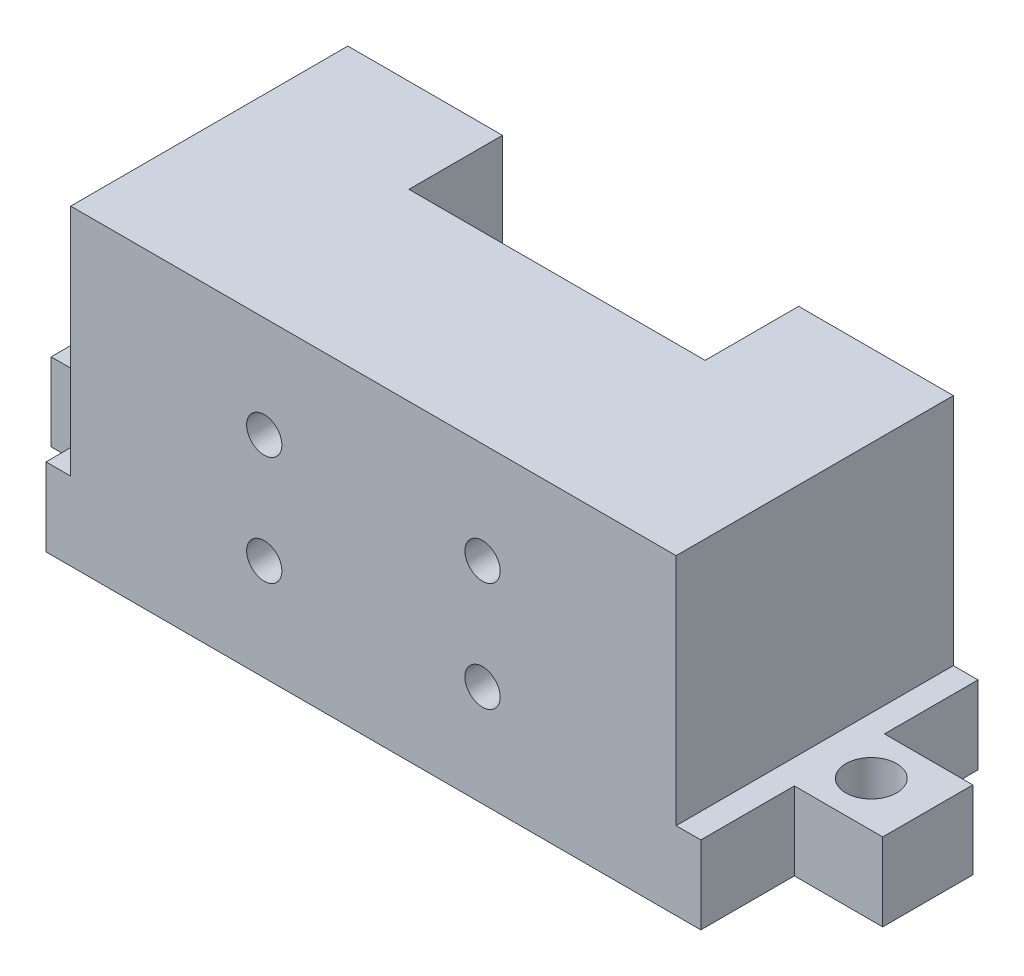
ISO-10303-21;
HEADER;
FILE_DESCRIPTION(('STEP AP214'),'2;1');
FILE_NAME('part.step','',(''),(''),'','','');
FILE_SCHEMA(('AUTOMOTIVE_DESIGN { 1 0 10303 214 1 1 1 1 }'));
ENDSEC;
DATA;
#1=APPLICATION_CONTEXT('core data for automotive mechanical design processes');
#2=APPLICATION_PROTOCOL_DEFINITION('international standard','automotive_design',2000,#1);
#3=PRODUCT_CONTEXT('',#1,'mechanical');
#4=PRODUCT('Part','Part','',(#3));
#5=PRODUCT_RELATED_PRODUCT_CATEGORY('part','',(#4));
#6=PRODUCT_DEFINITION_FORMATION('','',#4);
#7=PRODUCT_DEFINITION_CONTEXT('part definition',#1,'design');
#8=PRODUCT_DEFINITION('design','',#6,#7);
#9=PRODUCT_DEFINITION_SHAPE('','',#8);
#10=(LENGTH_UNIT() NAMED_UNIT(*) SI_UNIT(.MILLI.,.METRE.));
#11=(NAMED_UNIT(*) PLANE_ANGLE_UNIT() SI_UNIT($,.RADIAN.));
#12=(NAMED_UNIT(*) SI_UNIT($,.STERADIAN.) SOLID_ANGLE_UNIT());
#13=UNCERTAINTY_MEASURE_WITH_UNIT(LENGTH_MEASURE(1.E-05),#10,'distance_accuracy_value','');
#14=(GEOMETRIC_REPRESENTATION_CONTEXT(3) GLOBAL_UNCERTAINTY_ASSIGNED_CONTEXT((#13)) GLOBAL_UNIT_ASSIGNED_CONTEXT((#10,
#11,#12)) REPRESENTATION_CONTEXT('',''));
#15=CARTESIAN_POINT('',(0.,0.,0.));
#16=DIRECTION('',(0.,0.,1.));
#17=DIRECTION('',(1.,0.,0.));
#18=AXIS2_PLACEMENT_3D('',#15,#16,#17);
#19=CARTESIAN_POINT('',(53.34,20.,0.));
#20=DIRECTION('',(-1.,0.,0.));
#21=DIRECTION('',(0.,0.,1.));
#22=AXIS2_PLACEMENT_3D('',#19,#20,#21);
#23=PLANE('',#22);
#24=DIRECTION('',(0.,0.,-1.));
#25=VECTOR('',#24,1.);
#26=CARTESIAN_POINT('',(53.34,5.,0.));
#27=LINE('',#26,#25);
#28=CARTESIAN_POINT('',(53.34,5.,-6.));
#29=VERTEX_POINT('',#28);
#30=CARTESIAN_POINT('',(53.34,5.,-11.78));
#31=VERTEX_POINT('',#30);
#32=EDGE_CURVE('E199',#29,#31,#27,.T.);
#33=ORIENTED_EDGE('',*,*,#32,.F.);
#34=DIRECTION('',(0.,1.,0.));
#35=VECTOR('',#34,1.);
#36=CARTESIAN_POINT('',(53.34,0.,-6.));
#37=LINE('',#36,#35);
#38=CARTESIAN_POINT('',(53.34,0.,-6.));
#39=VERTEX_POINT('',#38);
#40=EDGE_CURVE('E292',#39,#29,#37,.T.);
#41=ORIENTED_EDGE('',*,*,#40,.F.);
#42=DIRECTION('',(0.,0.,-1.));
#43=VECTOR('',#42,1.);
#44=CARTESIAN_POINT('',(53.34,0.,0.));
#45=LINE('',#44,#43);
#46=CARTESIAN_POINT('',(53.34,0.,-11.78));
#47=VERTEX_POINT('',#46);
#48=EDGE_CURVE('E321',#39,#47,#45,.T.);
#49=ORIENTED_EDGE('',*,*,#48,.T.);
#50=DIRECTION('',(0.,1.,0.));
#51=VECTOR('',#50,1.);
#52=CARTESIAN_POINT('',(53.34,0.,-11.78));
#53=LINE('',#52,#51);
#54=EDGE_CURVE('E260',#47,#31,#53,.T.);
#55=ORIENTED_EDGE('',*,*,#54,.T.);
#56=EDGE_LOOP('',(#33,#41,#49,#55));
#57=FACE_BOUND('',#56,.T.);
#58=ADVANCED_FACE('F33',(#57),#23,.F.);
#59=CARTESIAN_POINT('',(47.6729837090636,0.,0.));
#60=DIRECTION('',(-1.,0.,0.));
#61=DIRECTION('',(0.,0.,1.));
#62=AXIS2_PLACEMENT_3D('',#59,#60,#61);
#63=PLANE('',#62);
#64=DIRECTION('',(0.,0.,-1.));
#65=VECTOR('',#64,1.);
#66=CARTESIAN_POINT('',(47.6729837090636,5.,0.));
#67=LINE('',#66,#65);
#68=CARTESIAN_POINT('',(47.6729837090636,5.,0.));
#69=VERTEX_POINT('',#68);
#70=CARTESIAN_POINT('',(47.6729837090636,5.,-6.));
#71=VERTEX_POINT('',#70);
#72=EDGE_CURVE('E203',#69,#71,#67,.T.);
#73=ORIENTED_EDGE('',*,*,#72,.F.);
#74=DIRECTION('',(0.,1.,0.));
#75=VECTOR('',#74,1.);
#76=CARTESIAN_POINT('',(47.6729837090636,0.,0.));
#77=LINE('',#76,#75);
#78=CARTESIAN_POINT('',(47.6729837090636,0.,0.));
#79=VERTEX_POINT('',#78);
#80=EDGE_CURVE('E190',#79,#69,#77,.T.);
#81=ORIENTED_EDGE('',*,*,#80,.F.);
#82=DIRECTION('',(0.,0.,1.));
#83=VECTOR('',#82,1.);
#84=CARTESIAN_POINT('',(47.6729837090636,0.,0.));
#85=LINE('',#84,#83);
#86=CARTESIAN_POINT('',(47.6729837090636,0.,-6.));
#87=VERTEX_POINT('',#86);
#88=EDGE_CURVE('E289',#87,#79,#85,.T.);
#89=ORIENTED_EDGE('',*,*,#88,.F.);
#90=DIRECTION('',(0.,1.,0.));
#91=VECTOR('',#90,1.);
#92=CARTESIAN_POINT('',(47.6729837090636,0.,-6.));
#93=LINE('',#92,#91);
#94=EDGE_CURVE('E294',#87,#71,#93,.T.);
#95=ORIENTED_EDGE('',*,*,#94,.T.);
#96=EDGE_LOOP('',(#73,#81,#89,#95));
#97=FACE_BOUND('',#96,.T.);
#98=ADVANCED_FACE('F401',(#97),#63,.F.);
#99=CARTESIAN_POINT('',(53.34,0.,-6.));
#100=DIRECTION('',(0.,0.,-1.));
#101=DIRECTION('',(-1.,0.,0.));
#102=AXIS2_PLACEMENT_3D('',#99,#100,#101);
#103=PLANE('',#102);
#104=DIRECTION('',(1.,0.,0.));
#105=VECTOR('',#104,1.);
#106=CARTESIAN_POINT('',(53.34,5.,-6.));
#107=LINE('',#106,#105);
#108=EDGE_CURVE('E201',#71,#29,#107,.T.);
#109=ORIENTED_EDGE('',*,*,#108,.F.);
#110=ORIENTED_EDGE('',*,*,#94,.F.);
#111=DIRECTION('',(-1.,0.,0.));
#112=VECTOR('',#111,1.);
#113=CARTESIAN_POINT('',(53.34,0.,-6.));
#114=LINE('',#113,#112);
#115=EDGE_CURVE('E249',#39,#87,#114,.T.);
#116=ORIENTED_EDGE('',*,*,#115,.F.);
#117=ORIENTED_EDGE('',*,*,#40,.T.);
#118=EDGE_LOOP('',(#109,#110,#116,#117));
#119=FACE_BOUND('',#118,.T.);
#120=ADVANCED_FACE('F374',(#119),#103,.F.);
#121=CARTESIAN_POINT('',(53.34,0.,-11.78));
#122=DIRECTION('',(0.,0.,1.));
#123=DIRECTION('',(1.,0.,0.));
#124=AXIS2_PLACEMENT_3D('',#121,#122,#123);
#125=PLANE('',#124);
#126=DIRECTION('',(-1.,0.,0.));
#127=VECTOR('',#126,1.);
#128=CARTESIAN_POINT('',(53.34,5.,-11.78));
#129=LINE('',#128,#127);
#130=CARTESIAN_POINT('',(47.6729837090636,5.,-11.78));
#131=VERTEX_POINT('',#130);
#132=EDGE_CURVE('E47',#31,#131,#129,.T.);
#133=ORIENTED_EDGE('',*,*,#132,.F.);
#134=ORIENTED_EDGE('',*,*,#54,.F.);
#135=DIRECTION('',(1.,0.,0.));
#136=VECTOR('',#135,1.);
#137=CARTESIAN_POINT('',(53.34,0.,-11.78));
#138=LINE('',#137,#136);
#139=CARTESIAN_POINT('',(47.6729837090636,0.,-11.78));
#140=VERTEX_POINT('',#139);
#141=EDGE_CURVE('E276',#140,#47,#138,.T.);
#142=ORIENTED_EDGE('',*,*,#141,.F.);
#143=DIRECTION('',(0.,1.,0.));
#144=VECTOR('',#143,1.);
#145=CARTESIAN_POINT('',(47.6729837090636,0.,-11.78));
#146=LINE('',#145,#144);
#147=EDGE_CURVE('E282',#140,#131,#146,.T.);
#148=ORIENTED_EDGE('',*,*,#147,.T.);
#149=EDGE_LOOP('',(#133,#134,#142,#148));
#150=FACE_BOUND('',#149,.T.);
#151=ADVANCED_FACE('F547',(#150),#125,.F.);
#152=CARTESIAN_POINT('',(47.6729837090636,0.,-17.78));
#153=DIRECTION('',(-1.,0.,0.));
#154=DIRECTION('',(0.,0.,1.));
#155=AXIS2_PLACEMENT_3D('',#152,#153,#154);
#156=PLANE('',#155);
#157=DIRECTION('',(0.,0.,-1.));
#158=VECTOR('',#157,1.);
#159=CARTESIAN_POINT('',(47.6729837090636,5.,-17.78));
#160=LINE('',#159,#158);
#161=CARTESIAN_POINT('',(47.6729837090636,5.,-17.78));
#162=VERTEX_POINT('',#161);
#163=EDGE_CURVE('E11',#131,#162,#160,.T.);
#164=ORIENTED_EDGE('',*,*,#163,.F.);
#165=ORIENTED_EDGE('',*,*,#147,.F.);
#166=DIRECTION('',(0.,0.,1.));
#167=VECTOR('',#166,1.);
#168=CARTESIAN_POINT('',(47.6729837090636,0.,-17.78));
#169=LINE('',#168,#167);
#170=CARTESIAN_POINT('',(47.6729837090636,0.,-17.78));
#171=VERTEX_POINT('',#170);
#172=EDGE_CURVE('E273',#171,#140,#169,.T.);
#173=ORIENTED_EDGE('',*,*,#172,.F.);
#174=DIRECTION('',(0.,1.,0.));
#175=VECTOR('',#174,1.);
#176=CARTESIAN_POINT('',(47.6729837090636,0.,-17.78));
#177=LINE('',#176,#175);
#178=EDGE_CURVE('E279',#171,#162,#177,.T.);
#179=ORIENTED_EDGE('',*,*,#178,.T.);
#180=EDGE_LOOP('',(#164,#165,#173,#179));
#181=FACE_BOUND('',#180,.T.);
#182=ADVANCED_FACE('F365',(#181),#156,.F.);
#183=CARTESIAN_POINT('',(0.,20.,-17.78));
#184=DIRECTION('',(0.,0.,-1.));
#185=DIRECTION('',(-1.,0.,0.));
#186=AXIS2_PLACEMENT_3D('',#183,#184,#185);
#187=PLANE('',#186);
#188=DIRECTION('',(0.,1.,0.));
#189=VECTOR('',#188,1.);
#190=CARTESIAN_POINT('',(7.2539802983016,5.,-17.78));
#191=LINE('',#190,#189);
#192=CARTESIAN_POINT('',(7.2539802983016,5.,-17.78));
#193=VERTEX_POINT('',#192);
#194=CARTESIAN_POINT('',(7.2539802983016,20.,-17.78));
#195=VERTEX_POINT('',#194);
#196=EDGE_CURVE('E217',#193,#195,#191,.T.);
#197=ORIENTED_EDGE('',*,*,#196,.T.);
#198=DIRECTION('',(1.,0.,0.));
#199=VECTOR('',#198,1.);
#200=CARTESIAN_POINT('',(0.,20.,-17.78));
#201=LINE('',#200,#199);
#202=CARTESIAN_POINT('',(17.17,20.,-17.78));
#203=VERTEX_POINT('',#202);
#204=EDGE_CURVE('E318',#195,#203,#201,.T.);
#205=ORIENTED_EDGE('',*,*,#204,.T.);
#206=DIRECTION('',(0.,1.,0.));
#207=VECTOR('',#206,1.);
#208=CARTESIAN_POINT('',(17.17,0.,-17.78));
#209=LINE('',#208,#207);
#210=CARTESIAN_POINT('',(17.17,0.,-17.78));
#211=VERTEX_POINT('',#210);
#212=EDGE_CURVE('E246',#211,#203,#209,.T.);
#213=ORIENTED_EDGE('',*,*,#212,.F.);
#214=DIRECTION('',(1.,0.,0.));
#215=VECTOR('',#214,1.);
#216=CARTESIAN_POINT('',(0.,0.,-17.78));
#217=LINE('',#216,#215);
#218=CARTESIAN_POINT('',(5.67,0.,-17.78));
#219=VERTEX_POINT('',#218);
#220=EDGE_CURVE('E325',#219,#211,#217,.T.);
#221=ORIENTED_EDGE('',*,*,#220,.F.);
#222=DIRECTION('',(0.,1.,0.));
#223=VECTOR('',#222,1.);
#224=CARTESIAN_POINT('',(5.67,0.,-17.78));
#225=LINE('',#224,#223);
#226=CARTESIAN_POINT('',(5.67,5.,-17.78));
#227=VERTEX_POINT('',#226);
#228=EDGE_CURVE('E264',#219,#227,#225,.T.);
#229=ORIENTED_EDGE('',*,*,#228,.T.);
#230=DIRECTION('',(-1.,0.,0.));
#231=VECTOR('',#230,1.);
#232=CARTESIAN_POINT('',(0.,5.,-17.78));
#233=LINE('',#232,#231);
#234=EDGE_CURVE('E213',#193,#227,#233,.T.);
#235=ORIENTED_EDGE('',*,*,#234,.F.);
#236=EDGE_LOOP('',(#197,#205,#213,#221,#229,#235));
#237=FACE_BOUND('',#236,.T.);
#238=ADVANCED_FACE('F341',(#237),#187,.T.);
#239=CARTESIAN_POINT('',(0.,20.,0.));
#240=DIRECTION('',(0.,0.,-1.));
#241=DIRECTION('',(-1.,0.,0.));
#242=AXIS2_PLACEMENT_3D('',#239,#240,#241);
#243=PLANE('',#242);
#244=CARTESIAN_POINT('',(19.67,6.5,0.));
#245=DIRECTION('',(0.,0.,-1.));
#246=DIRECTION('',(-1.,0.,0.));
#247=AXIS2_PLACEMENT_3D('',#244,#245,#246);
#248=CIRCLE('',#247,1.13);
#249=CARTESIAN_POINT('',(18.54,6.5,0.));
#250=VERTEX_POINT('',#249);
#251=EDGE_CURVE('E635',#250,#250,#248,.T.);
#252=ORIENTED_EDGE('',*,*,#251,.T.);
#253=EDGE_LOOP('',(#252));
#254=FACE_BOUND('',#253,.T.);
#255=CARTESIAN_POINT('',(33.67,13.5,0.));
#256=DIRECTION('',(0.,0.,-1.));
#257=DIRECTION('',(-1.,0.,0.));
#258=AXIS2_PLACEMENT_3D('',#255,#256,#257);
#259=CIRCLE('',#258,1.13);
#260=CARTESIAN_POINT('',(32.54,13.5,0.));
#261=VERTEX_POINT('',#260);
#262=EDGE_CURVE('E639',#261,#261,#259,.T.);
#263=ORIENTED_EDGE('',*,*,#262,.T.);
#264=EDGE_LOOP('',(#263));
#265=FACE_BOUND('',#264,.T.);
#266=CARTESIAN_POINT('',(33.67,6.5,0.));
#267=DIRECTION('',(0.,0.,-1.));
#268=DIRECTION('',(-1.,0.,0.));
#269=AXIS2_PLACEMENT_3D('',#266,#267,#268);
#270=CIRCLE('',#269,1.13);
#271=CARTESIAN_POINT('',(32.54,6.5,0.));
#272=VERTEX_POINT('',#271);
#273=EDGE_CURVE('E649',#272,#272,#270,.T.);
#274=ORIENTED_EDGE('',*,*,#273,.T.);
#275=EDGE_LOOP('',(#274));
#276=FACE_BOUND('',#275,.T.);
#277=CARTESIAN_POINT('',(19.67,13.5,0.));
#278=DIRECTION('',(0.,0.,-1.));
#279=DIRECTION('',(-1.,0.,0.));
#280=AXIS2_PLACEMENT_3D('',#277,#278,#279);
#281=CIRCLE('',#280,1.13);
#282=CARTESIAN_POINT('',(18.54,13.5,0.));
#283=VERTEX_POINT('',#282);
#284=EDGE_CURVE('E655',#283,#283,#281,.T.);
#285=ORIENTED_EDGE('',*,*,#284,.T.);
#286=EDGE_LOOP('',(#285));
#287=FACE_BOUND('',#286,.T.);
#288=DIRECTION('',(1.,0.,0.));
#289=VECTOR('',#288,1.);
#290=CARTESIAN_POINT('',(46.09,5.,0.));
#291=LINE('',#290,#289);
#292=CARTESIAN_POINT('',(46.09,5.,0.));
#293=VERTEX_POINT('',#292);
#294=EDGE_CURVE('E184',#293,#69,#291,.T.);
#295=ORIENTED_EDGE('',*,*,#294,.F.);
#296=DIRECTION('',(0.,1.,0.));
#297=VECTOR('',#296,1.);
#298=CARTESIAN_POINT('',(46.09,5.,0.));
#299=LINE('',#298,#297);
#300=CARTESIAN_POINT('',(46.09,20.,0.));
#301=VERTEX_POINT('',#300);
#302=EDGE_CURVE('E169',#293,#301,#299,.T.);
#303=ORIENTED_EDGE('',*,*,#302,.T.);
#304=DIRECTION('',(1.,0.,0.));
#305=VECTOR('',#304,1.);
#306=CARTESIAN_POINT('',(0.,20.,0.));
#307=LINE('',#306,#305);
#308=CARTESIAN_POINT('',(7.2539802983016,20.,0.));
#309=VERTEX_POINT('',#308);
#310=EDGE_CURVE('E314',#309,#301,#307,.T.);
#311=ORIENTED_EDGE('',*,*,#310,.F.);
#312=DIRECTION('',(0.,1.,0.));
#313=VECTOR('',#312,1.);
#314=CARTESIAN_POINT('',(7.2539802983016,5.,0.));
#315=LINE('',#314,#313);
#316=CARTESIAN_POINT('',(7.2539802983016,5.,0.));
#317=VERTEX_POINT('',#316);
#318=EDGE_CURVE('E215',#317,#309,#315,.T.);
#319=ORIENTED_EDGE('',*,*,#318,.F.);
#320=DIRECTION('',(1.,0.,0.));
#321=VECTOR('',#320,1.);
#322=CARTESIAN_POINT('',(0.,5.,0.));
#323=LINE('',#322,#321);
#324=CARTESIAN_POINT('',(5.67,5.,0.));
#325=VERTEX_POINT('',#324);
#326=EDGE_CURVE('E208',#325,#317,#323,.T.);
#327=ORIENTED_EDGE('',*,*,#326,.F.);
#328=DIRECTION('',(0.,1.,0.));
#329=VECTOR('',#328,1.);
#330=CARTESIAN_POINT('',(5.67,0.,0.));
#331=LINE('',#330,#329);
#332=CARTESIAN_POINT('',(5.67,0.,0.));
#333=VERTEX_POINT('',#332);
#334=EDGE_CURVE('E304',#333,#325,#331,.T.);
#335=ORIENTED_EDGE('',*,*,#334,.F.);
#336=DIRECTION('',(1.,0.,0.));
#337=VECTOR('',#336,1.);
#338=CARTESIAN_POINT('',(0.,0.,0.));
#339=LINE('',#338,#337);
#340=EDGE_CURVE('E308',#333,#79,#339,.T.);
#341=ORIENTED_EDGE('',*,*,#340,.T.);
#342=ORIENTED_EDGE('',*,*,#80,.T.);
#343=EDGE_LOOP('',(#295,#303,#311,#319,#327,#335,#341,#342));
#344=FACE_BOUND('',#343,.T.);
#345=ADVANCED_FACE('F35',(#254,#265,#276,#287,#344),#243,.F.);
#346=DIRECTION('',(0.,1.,0.));
#347=VECTOR('',#346,1.);
#348=CARTESIAN_POINT('',(46.09,5.,-17.78));
#349=LINE('',#348,#347);
#350=CARTESIAN_POINT('',(46.09,5.,-17.78));
#351=VERTEX_POINT('',#350);
#352=CARTESIAN_POINT('',(46.09,20.,-17.78));
#353=VERTEX_POINT('',#352);
#354=EDGE_CURVE('E180',#351,#353,#349,.T.);
#355=ORIENTED_EDGE('',*,*,#354,.F.);
#356=DIRECTION('',(-1.,0.,0.));
#357=VECTOR('',#356,1.);
#358=CARTESIAN_POINT('',(46.09,5.,-17.78));
#359=LINE('',#358,#357);
#360=EDGE_CURVE('E181',#162,#351,#359,.T.);
#361=ORIENTED_EDGE('',*,*,#360,.F.);
#362=ORIENTED_EDGE('',*,*,#178,.F.);
#363=CARTESIAN_POINT('',(36.17,0.,-17.78));
#364=VERTEX_POINT('',#363);
#365=EDGE_CURVE('E324',#364,#171,#217,.T.);
#366=ORIENTED_EDGE('',*,*,#365,.F.);
#367=DIRECTION('',(0.,1.,0.));
#368=VECTOR('',#367,1.);
#369=CARTESIAN_POINT('',(36.17,0.,-17.78));
#370=LINE('',#369,#368);
#371=CARTESIAN_POINT('',(36.17,20.,-17.78));
#372=VERTEX_POINT('',#371);
#373=EDGE_CURVE('E250',#364,#372,#370,.T.);
#374=ORIENTED_EDGE('',*,*,#373,.T.);
#375=EDGE_CURVE('E316',#372,#353,#201,.T.);
#376=ORIENTED_EDGE('',*,*,#375,.T.);
#377=EDGE_LOOP('',(#355,#361,#362,#366,#374,#376));
#378=FACE_BOUND('',#377,.T.);
#379=ADVANCED_FACE('F362',(#378),#187,.T.);
#380=CARTESIAN_POINT('',(0.,20.,0.));
#381=DIRECTION('',(-1.,0.,0.));
#382=DIRECTION('',(0.,0.,1.));
#383=AXIS2_PLACEMENT_3D('',#380,#381,#382);
#384=PLANE('',#383);
#385=DIRECTION('',(0.,0.,1.));
#386=VECTOR('',#385,1.);
#387=CARTESIAN_POINT('',(0.,5.,0.));
#388=LINE('',#387,#386);
#389=CARTESIAN_POINT('',(0.,5.,-11.78));
#390=VERTEX_POINT('',#389);
#391=CARTESIAN_POINT('',(0.,5.,-6.));
#392=VERTEX_POINT('',#391);
#393=EDGE_CURVE('E206',#390,#392,#388,.T.);
#394=ORIENTED_EDGE('',*,*,#393,.F.);
#395=DIRECTION('',(0.,1.,0.));
#396=VECTOR('',#395,1.);
#397=CARTESIAN_POINT('',(0.,0.,-11.78));
#398=LINE('',#397,#396);
#399=CARTESIAN_POINT('',(0.,0.,-11.78));
#400=VERTEX_POINT('',#399);
#401=EDGE_CURVE('E263',#400,#390,#398,.T.);
#402=ORIENTED_EDGE('',*,*,#401,.F.);
#403=DIRECTION('',(0.,0.,-1.));
#404=VECTOR('',#403,1.);
#405=CARTESIAN_POINT('',(0.,0.,0.));
#406=LINE('',#405,#404);
#407=CARTESIAN_POINT('',(0.,0.,-6.));
#408=VERTEX_POINT('',#407);
#409=EDGE_CURVE('E317',#408,#400,#406,.T.);
#410=ORIENTED_EDGE('',*,*,#409,.F.);
#411=DIRECTION('',(0.,1.,0.));
#412=VECTOR('',#411,1.);
#413=CARTESIAN_POINT('',(0.,0.,-6.));
#414=LINE('',#413,#412);
#415=EDGE_CURVE('E305',#408,#392,#414,.T.);
#416=ORIENTED_EDGE('',*,*,#415,.T.);
#417=EDGE_LOOP('',(#394,#402,#410,#416));
#418=FACE_BOUND('',#417,.T.);
#419=ADVANCED_FACE('F387',(#418),#384,.T.);
#420=CARTESIAN_POINT('',(0.,20.,0.));
#421=DIRECTION('',(0.,1.,0.));
#422=DIRECTION('',(0.,0.,1.));
#423=AXIS2_PLACEMENT_3D('',#420,#421,#422);
#424=PLANE('',#423);
#425=DIRECTION('',(0.,0.,1.));
#426=VECTOR('',#425,1.);
#427=CARTESIAN_POINT('',(46.09,20.,-17.78));
#428=LINE('',#427,#426);
#429=EDGE_CURVE('E175',#353,#301,#428,.T.);
#430=ORIENTED_EDGE('',*,*,#429,.F.);
#431=ORIENTED_EDGE('',*,*,#375,.F.);
#432=DIRECTION('',(0.,0.,-1.));
#433=VECTOR('',#432,1.);
#434=CARTESIAN_POINT('',(36.17,20.,-17.78));
#435=LINE('',#434,#433);
#436=CARTESIAN_POINT('',(36.17,20.,-11.78));
#437=VERTEX_POINT('',#436);
#438=EDGE_CURVE('E233',#437,#372,#435,.T.);
#439=ORIENTED_EDGE('',*,*,#438,.F.);
#440=DIRECTION('',(1.,0.,0.));
#441=VECTOR('',#440,1.);
#442=CARTESIAN_POINT('',(17.17,20.,-11.78));
#443=LINE('',#442,#441);
#444=CARTESIAN_POINT('',(17.17,20.,-11.78));
#445=VERTEX_POINT('',#444);
#446=EDGE_CURVE('E242',#445,#437,#443,.T.);
#447=ORIENTED_EDGE('',*,*,#446,.F.);
#448=DIRECTION('',(0.,0.,1.));
#449=VECTOR('',#448,1.);
#450=CARTESIAN_POINT('',(17.17,20.,-17.78));
#451=LINE('',#450,#449);
#452=EDGE_CURVE('E228',#203,#445,#451,.T.);
#453=ORIENTED_EDGE('',*,*,#452,.F.);
#454=ORIENTED_EDGE('',*,*,#204,.F.);
#455=DIRECTION('',(0.,0.,-1.));
#456=VECTOR('',#455,1.);
#457=CARTESIAN_POINT('',(7.2539802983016,20.,0.));
#458=LINE('',#457,#456);
#459=EDGE_CURVE('E205',#309,#195,#458,.T.);
#460=ORIENTED_EDGE('',*,*,#459,.F.);
#461=ORIENTED_EDGE('',*,*,#310,.T.);
#462=EDGE_LOOP('',(#430,#431,#439,#447,#453,#454,#460,#461));
#463=FACE_BOUND('',#462,.T.);
#464=ADVANCED_FACE('F349',(#463),#424,.T.);
#465=CARTESIAN_POINT('',(0.,0.,0.));
#466=DIRECTION('',(0.,1.,0.));
#467=DIRECTION('',(0.,0.,1.));
#468=AXIS2_PLACEMENT_3D('',#465,#466,#467);
#469=PLANE('',#468);
#470=CARTESIAN_POINT('',(49.715,0.,-8.89));
#471=DIRECTION('',(0.,1.,0.));
#472=DIRECTION('',(0.,0.,1.));
#473=AXIS2_PLACEMENT_3D('',#470,#471,#472);
#474=CIRCLE('',#473,1.63);
#475=CARTESIAN_POINT('',(49.715,0.,-7.26));
#476=VERTEX_POINT('',#475);
#477=EDGE_CURVE('E663',#476,#476,#474,.T.);
#478=ORIENTED_EDGE('',*,*,#477,.T.);
#479=EDGE_LOOP('',(#478));
#480=FACE_BOUND('',#479,.T.);
#481=CARTESIAN_POINT('',(3.625,0.,-8.89));
#482=DIRECTION('',(0.,1.,0.));
#483=DIRECTION('',(0.,0.,1.));
#484=AXIS2_PLACEMENT_3D('',#481,#482,#483);
#485=CIRCLE('',#484,1.63);
#486=CARTESIAN_POINT('',(3.625,0.,-7.26));
#487=VERTEX_POINT('',#486);
#488=EDGE_CURVE('E196',#487,#487,#485,.T.);
#489=ORIENTED_EDGE('',*,*,#488,.T.);
#490=EDGE_LOOP('',(#489));
#491=FACE_BOUND('',#490,.T.);
#492=ORIENTED_EDGE('',*,*,#220,.T.);
#493=DIRECTION('',(0.,0.,1.));
#494=VECTOR('',#493,1.);
#495=CARTESIAN_POINT('',(17.17,0.,-17.78));
#496=LINE('',#495,#494);
#497=CARTESIAN_POINT('',(17.17,0.,-11.78));
#498=VERTEX_POINT('',#497);
#499=EDGE_CURVE('E229',#211,#498,#496,.T.);
#500=ORIENTED_EDGE('',*,*,#499,.T.);
#501=DIRECTION('',(1.,0.,0.));
#502=VECTOR('',#501,1.);
#503=CARTESIAN_POINT('',(17.17,0.,-11.78));
#504=LINE('',#503,#502);
#505=CARTESIAN_POINT('',(36.17,0.,-11.78));
#506=VERTEX_POINT('',#505);
#507=EDGE_CURVE('E232',#498,#506,#504,.T.);
#508=ORIENTED_EDGE('',*,*,#507,.T.);
#509=DIRECTION('',(0.,0.,-1.));
#510=VECTOR('',#509,1.);
#511=CARTESIAN_POINT('',(36.17,0.,-17.78));
#512=LINE('',#511,#510);
#513=EDGE_CURVE('E236',#506,#364,#512,.T.);
#514=ORIENTED_EDGE('',*,*,#513,.T.);
#515=ORIENTED_EDGE('',*,*,#365,.T.);
#516=ORIENTED_EDGE('',*,*,#172,.T.);
#517=ORIENTED_EDGE('',*,*,#141,.T.);
#518=ORIENTED_EDGE('',*,*,#48,.F.);
#519=ORIENTED_EDGE('',*,*,#115,.T.);
#520=ORIENTED_EDGE('',*,*,#88,.T.);
#521=ORIENTED_EDGE('',*,*,#340,.F.);
#522=DIRECTION('',(0.,0.,-1.));
#523=VECTOR('',#522,1.);
#524=CARTESIAN_POINT('',(5.67,0.,0.));
#525=LINE('',#524,#523);
#526=CARTESIAN_POINT('',(5.67,0.,-6.));
#527=VERTEX_POINT('',#526);
#528=EDGE_CURVE('E267',#333,#527,#525,.T.);
#529=ORIENTED_EDGE('',*,*,#528,.T.);
#530=DIRECTION('',(-1.,0.,0.));
#531=VECTOR('',#530,1.);
#532=CARTESIAN_POINT('',(0.,0.,-6.));
#533=LINE('',#532,#531);
#534=EDGE_CURVE('E301',#527,#408,#533,.T.);
#535=ORIENTED_EDGE('',*,*,#534,.T.);
#536=ORIENTED_EDGE('',*,*,#409,.T.);
#537=DIRECTION('',(1.,0.,0.));
#538=VECTOR('',#537,1.);
#539=CARTESIAN_POINT('',(0.,0.,-11.78));
#540=LINE('',#539,#538);
#541=CARTESIAN_POINT('',(5.67,0.,-11.78));
#542=VERTEX_POINT('',#541);
#543=EDGE_CURVE('E256',#400,#542,#540,.T.);
#544=ORIENTED_EDGE('',*,*,#543,.T.);
#545=DIRECTION('',(0.,0.,-1.));
#546=VECTOR('',#545,1.);
#547=CARTESIAN_POINT('',(5.67,0.,-17.78));
#548=LINE('',#547,#546);
#549=EDGE_CURVE('E259',#542,#219,#548,.T.);
#550=ORIENTED_EDGE('',*,*,#549,.T.);
#551=EDGE_LOOP('',(#492,#500,#508,#514,#515,#516,#517,#518,#519,#520,#521,#529,#535,#536,#544,#550));
#552=FACE_BOUND('',#551,.T.);
#553=ADVANCED_FACE('F338',(#480,#491,#552),#469,.F.);
#554=CARTESIAN_POINT('',(0.,0.,-6.));
#555=DIRECTION('',(0.,0.,-1.));
#556=DIRECTION('',(-1.,0.,0.));
#557=AXIS2_PLACEMENT_3D('',#554,#555,#556);
#558=PLANE('',#557);
#559=DIRECTION('',(0.,1.,0.));
#560=VECTOR('',#559,1.);
#561=CARTESIAN_POINT('',(5.67,0.,-6.));
#562=LINE('',#561,#560);
#563=CARTESIAN_POINT('',(5.67,5.,-6.));
#564=VERTEX_POINT('',#563);
#565=EDGE_CURVE('E309',#527,#564,#562,.T.);
#566=ORIENTED_EDGE('',*,*,#565,.T.);
#567=DIRECTION('',(-1.,0.,0.));
#568=VECTOR('',#567,1.);
#569=CARTESIAN_POINT('',(0.,5.,-6.));
#570=LINE('',#569,#568);
#571=EDGE_CURVE('E225',#564,#392,#570,.T.);
#572=ORIENTED_EDGE('',*,*,#571,.T.);
#573=ORIENTED_EDGE('',*,*,#415,.F.);
#574=ORIENTED_EDGE('',*,*,#534,.F.);
#575=EDGE_LOOP('',(#566,#572,#573,#574));
#576=FACE_BOUND('',#575,.T.);
#577=ADVANCED_FACE('F389',(#576),#558,.F.);
#578=CARTESIAN_POINT('',(5.67,0.,0.));
#579=DIRECTION('',(1.,0.,0.));
#580=DIRECTION('',(0.,0.,-1.));
#581=AXIS2_PLACEMENT_3D('',#578,#579,#580);
#582=PLANE('',#581);
#583=ORIENTED_EDGE('',*,*,#334,.T.);
#584=DIRECTION('',(0.,0.,-1.));
#585=VECTOR('',#584,1.);
#586=CARTESIAN_POINT('',(5.67,5.,0.));
#587=LINE('',#586,#585);
#588=EDGE_CURVE('E222',#325,#564,#587,.T.);
#589=ORIENTED_EDGE('',*,*,#588,.T.);
#590=ORIENTED_EDGE('',*,*,#565,.F.);
#591=ORIENTED_EDGE('',*,*,#528,.F.);
#592=EDGE_LOOP('',(#583,#589,#590,#591));
#593=FACE_BOUND('',#592,.T.);
#594=ADVANCED_FACE('F382',(#593),#582,.F.);
#595=CARTESIAN_POINT('',(5.67,0.,-17.78));
#596=DIRECTION('',(1.,0.,0.));
#597=DIRECTION('',(0.,0.,-1.));
#598=AXIS2_PLACEMENT_3D('',#595,#596,#597);
#599=PLANE('',#598);
#600=DIRECTION('',(0.,1.,0.));
#601=VECTOR('',#600,1.);
#602=CARTESIAN_POINT('',(5.67,0.,-11.78));
#603=LINE('',#602,#601);
#604=CARTESIAN_POINT('',(5.67,5.,-11.78));
#605=VERTEX_POINT('',#604);
#606=EDGE_CURVE('E268',#542,#605,#603,.T.);
#607=ORIENTED_EDGE('',*,*,#606,.T.);
#608=DIRECTION('',(0.,0.,-1.));
#609=VECTOR('',#608,1.);
#610=CARTESIAN_POINT('',(5.67,5.,-17.78));
#611=LINE('',#610,#609);
#612=EDGE_CURVE('E55',#605,#227,#611,.T.);
#613=ORIENTED_EDGE('',*,*,#612,.T.);
#614=ORIENTED_EDGE('',*,*,#228,.F.);
#615=ORIENTED_EDGE('',*,*,#549,.F.);
#616=EDGE_LOOP('',(#607,#613,#614,#615));
#617=FACE_BOUND('',#616,.T.);
#618=ADVANCED_FACE('F335',(#617),#599,.F.);
#619=CARTESIAN_POINT('',(0.,0.,-11.78));
#620=DIRECTION('',(0.,0.,1.));
#621=DIRECTION('',(1.,0.,0.));
#622=AXIS2_PLACEMENT_3D('',#619,#620,#621);
#623=PLANE('',#622);
#624=ORIENTED_EDGE('',*,*,#401,.T.);
#625=DIRECTION('',(1.,0.,0.));
#626=VECTOR('',#625,1.);
#627=CARTESIAN_POINT('',(0.,5.,-11.78));
#628=LINE('',#627,#626);
#629=EDGE_CURVE('E41',#390,#605,#628,.T.);
#630=ORIENTED_EDGE('',*,*,#629,.T.);
#631=ORIENTED_EDGE('',*,*,#606,.F.);
#632=ORIENTED_EDGE('',*,*,#543,.F.);
#633=EDGE_LOOP('',(#624,#630,#631,#632));
#634=FACE_BOUND('',#633,.T.);
#635=ADVANCED_FACE('F331',(#634),#623,.F.);
#636=CARTESIAN_POINT('',(17.17,0.,-17.78));
#637=DIRECTION('',(-1.,0.,0.));
#638=DIRECTION('',(0.,0.,1.));
#639=AXIS2_PLACEMENT_3D('',#636,#637,#638);
#640=PLANE('',#639);
#641=ORIENTED_EDGE('',*,*,#452,.T.);
#642=DIRECTION('',(0.,1.,0.));
#643=VECTOR('',#642,1.);
#644=CARTESIAN_POINT('',(17.17,0.,-11.78));
#645=LINE('',#644,#643);
#646=EDGE_CURVE('E239',#498,#445,#645,.T.);
#647=ORIENTED_EDGE('',*,*,#646,.F.);
#648=ORIENTED_EDGE('',*,*,#499,.F.);
#649=ORIENTED_EDGE('',*,*,#212,.T.);
#650=EDGE_LOOP('',(#641,#647,#648,#649));
#651=FACE_BOUND('',#650,.T.);
#652=ADVANCED_FACE('F346',(#651),#640,.F.);
#653=CARTESIAN_POINT('',(36.17,0.,-17.78));
#654=DIRECTION('',(1.,0.,0.));
#655=DIRECTION('',(0.,0.,-1.));
#656=AXIS2_PLACEMENT_3D('',#653,#654,#655);
#657=PLANE('',#656);
#658=ORIENTED_EDGE('',*,*,#438,.T.);
#659=ORIENTED_EDGE('',*,*,#373,.F.);
#660=ORIENTED_EDGE('',*,*,#513,.F.);
#661=DIRECTION('',(0.,1.,0.));
#662=VECTOR('',#661,1.);
#663=CARTESIAN_POINT('',(36.17,0.,-11.78));
#664=LINE('',#663,#662);
#665=EDGE_CURVE('E253',#506,#437,#664,.T.);
#666=ORIENTED_EDGE('',*,*,#665,.T.);
#667=EDGE_LOOP('',(#658,#659,#660,#666));
#668=FACE_BOUND('',#667,.T.);
#669=ADVANCED_FACE('F490',(#668),#657,.F.);
#670=CARTESIAN_POINT('',(17.17,0.,-11.78));
#671=DIRECTION('',(0.,0.,1.));
#672=DIRECTION('',(1.,0.,0.));
#673=AXIS2_PLACEMENT_3D('',#670,#671,#672);
#674=PLANE('',#673);
#675=CARTESIAN_POINT('',(19.67,6.5,-11.78));
#676=DIRECTION('',(0.,0.,-1.));
#677=DIRECTION('',(-1.,0.,0.));
#678=AXIS2_PLACEMENT_3D('',#675,#676,#677);
#679=CIRCLE('',#678,1.13);
#680=CARTESIAN_POINT('',(18.54,6.5,-11.78));
#681=VERTEX_POINT('',#680);
#682=EDGE_CURVE('E638',#681,#681,#679,.T.);
#683=ORIENTED_EDGE('',*,*,#682,.F.);
#684=EDGE_LOOP('',(#683));
#685=FACE_BOUND('',#684,.T.);
#686=CARTESIAN_POINT('',(33.67,13.5,-11.78));
#687=DIRECTION('',(0.,0.,-1.));
#688=DIRECTION('',(-1.,0.,0.));
#689=AXIS2_PLACEMENT_3D('',#686,#687,#688);
#690=CIRCLE('',#689,1.13);
#691=CARTESIAN_POINT('',(32.54,13.5,-11.78));
#692=VERTEX_POINT('',#691);
#693=EDGE_CURVE('E644',#692,#692,#690,.T.);
#694=ORIENTED_EDGE('',*,*,#693,.F.);
#695=EDGE_LOOP('',(#694));
#696=FACE_BOUND('',#695,.T.);
#697=CARTESIAN_POINT('',(33.67,6.5,-11.78));
#698=DIRECTION('',(0.,0.,-1.));
#699=DIRECTION('',(-1.,0.,0.));
#700=AXIS2_PLACEMENT_3D('',#697,#698,#699);
#701=CIRCLE('',#700,1.13);
#702=CARTESIAN_POINT('',(32.54,6.5,-11.78));
#703=VERTEX_POINT('',#702);
#704=EDGE_CURVE('E652',#703,#703,#701,.T.);
#705=ORIENTED_EDGE('',*,*,#704,.F.);
#706=EDGE_LOOP('',(#705));
#707=FACE_BOUND('',#706,.T.);
#708=CARTESIAN_POINT('',(19.67,13.5,-11.78));
#709=DIRECTION('',(0.,0.,-1.));
#710=DIRECTION('',(-1.,0.,0.));
#711=AXIS2_PLACEMENT_3D('',#708,#709,#710);
#712=CIRCLE('',#711,1.13);
#713=CARTESIAN_POINT('',(18.54,13.5,-11.78));
#714=VERTEX_POINT('',#713);
#715=EDGE_CURVE('E641',#714,#714,#712,.T.);
#716=ORIENTED_EDGE('',*,*,#715,.F.);
#717=EDGE_LOOP('',(#716));
#718=FACE_BOUND('',#717,.T.);
#719=ORIENTED_EDGE('',*,*,#446,.T.);
#720=ORIENTED_EDGE('',*,*,#665,.F.);
#721=ORIENTED_EDGE('',*,*,#507,.F.);
#722=ORIENTED_EDGE('',*,*,#646,.T.);
#723=EDGE_LOOP('',(#719,#720,#721,#722));
#724=FACE_BOUND('',#723,.T.);
#725=ADVANCED_FACE('F355',(#685,#696,#707,#718,#724),#674,.F.);
#726=CARTESIAN_POINT('',(0.,5.,0.));
#727=DIRECTION('',(0.,-1.,0.));
#728=DIRECTION('',(0.,0.,-1.));
#729=AXIS2_PLACEMENT_3D('',#726,#727,#728);
#730=PLANE('',#729);
#731=CARTESIAN_POINT('',(3.625,5.,-8.89));
#732=DIRECTION('',(0.,1.,0.));
#733=DIRECTION('',(0.,0.,1.));
#734=AXIS2_PLACEMENT_3D('',#731,#732,#733);
#735=CIRCLE('',#734,1.63);
#736=CARTESIAN_POINT('',(3.625,5.,-7.26));
#737=VERTEX_POINT('',#736);
#738=EDGE_CURVE('E666',#737,#737,#735,.T.);
#739=ORIENTED_EDGE('',*,*,#738,.F.);
#740=EDGE_LOOP('',(#739));
#741=FACE_BOUND('',#740,.T.);
#742=ORIENTED_EDGE('',*,*,#588,.F.);
#743=ORIENTED_EDGE('',*,*,#326,.T.);
#744=DIRECTION('',(0.,0.,-1.));
#745=VECTOR('',#744,1.);
#746=CARTESIAN_POINT('',(7.2539802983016,5.,0.));
#747=LINE('',#746,#745);
#748=EDGE_CURVE('E210',#317,#193,#747,.T.);
#749=ORIENTED_EDGE('',*,*,#748,.T.);
#750=ORIENTED_EDGE('',*,*,#234,.T.);
#751=ORIENTED_EDGE('',*,*,#612,.F.);
#752=ORIENTED_EDGE('',*,*,#629,.F.);
#753=ORIENTED_EDGE('',*,*,#393,.T.);
#754=ORIENTED_EDGE('',*,*,#571,.F.);
#755=EDGE_LOOP('',(#742,#743,#749,#750,#751,#752,#753,#754));
#756=FACE_BOUND('',#755,.T.);
#757=ADVANCED_FACE('F388',(#741,#756),#730,.F.);
#758=CARTESIAN_POINT('',(7.2539802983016,5.,0.));
#759=DIRECTION('',(1.,0.,0.));
#760=DIRECTION('',(0.,0.,-1.));
#761=AXIS2_PLACEMENT_3D('',#758,#759,#760);
#762=PLANE('',#761);
#763=ORIENTED_EDGE('',*,*,#459,.T.);
#764=ORIENTED_EDGE('',*,*,#196,.F.);
#765=ORIENTED_EDGE('',*,*,#748,.F.);
#766=ORIENTED_EDGE('',*,*,#318,.T.);
#767=EDGE_LOOP('',(#763,#764,#765,#766));
#768=FACE_BOUND('',#767,.T.);
#769=ADVANCED_FACE('F435',(#768),#762,.F.);
#770=CARTESIAN_POINT('',(0.,5.,0.));
#771=DIRECTION('',(0.,1.,0.));
#772=DIRECTION('',(0.,0.,1.));
#773=AXIS2_PLACEMENT_3D('',#770,#771,#772);
#774=PLANE('',#773);
#775=CARTESIAN_POINT('',(49.715,5.,-8.89));
#776=DIRECTION('',(0.,1.,0.));
#777=DIRECTION('',(0.,0.,1.));
#778=AXIS2_PLACEMENT_3D('',#775,#776,#777);
#779=CIRCLE('',#778,1.63);
#780=CARTESIAN_POINT('',(49.715,5.,-7.26));
#781=VERTEX_POINT('',#780);
#782=EDGE_CURVE('E658',#781,#781,#779,.T.);
#783=ORIENTED_EDGE('',*,*,#782,.F.);
#784=EDGE_LOOP('',(#783));
#785=FACE_BOUND('',#784,.T.);
#786=ORIENTED_EDGE('',*,*,#72,.T.);
#787=ORIENTED_EDGE('',*,*,#108,.T.);
#788=ORIENTED_EDGE('',*,*,#32,.T.);
#789=ORIENTED_EDGE('',*,*,#132,.T.);
#790=ORIENTED_EDGE('',*,*,#163,.T.);
#791=ORIENTED_EDGE('',*,*,#360,.T.);
#792=DIRECTION('',(0.,0.,1.));
#793=VECTOR('',#792,1.);
#794=CARTESIAN_POINT('',(46.09,5.,-17.78));
#795=LINE('',#794,#793);
#796=EDGE_CURVE('E172',#351,#293,#795,.T.);
#797=ORIENTED_EDGE('',*,*,#796,.T.);
#798=ORIENTED_EDGE('',*,*,#294,.T.);
#799=EDGE_LOOP('',(#786,#787,#788,#789,#790,#791,#797,#798));
#800=FACE_BOUND('',#799,.T.);
#801=ADVANCED_FACE('F183',(#785,#800),#774,.T.);
#802=CARTESIAN_POINT('',(46.09,5.,-17.78));
#803=DIRECTION('',(-1.,0.,0.));
#804=DIRECTION('',(0.,0.,1.));
#805=AXIS2_PLACEMENT_3D('',#802,#803,#804);
#806=PLANE('',#805);
#807=ORIENTED_EDGE('',*,*,#429,.T.);
#808=ORIENTED_EDGE('',*,*,#302,.F.);
#809=ORIENTED_EDGE('',*,*,#796,.F.);
#810=ORIENTED_EDGE('',*,*,#354,.T.);
#811=EDGE_LOOP('',(#807,#808,#809,#810));
#812=FACE_BOUND('',#811,.T.);
#813=ADVANCED_FACE('F171',(#812),#806,.F.);
#814=CARTESIAN_POINT('',(3.625,-10.,-8.89));
#815=DIRECTION('',(0.,1.,0.));
#816=DIRECTION('',(0.,0.,1.));
#817=AXIS2_PLACEMENT_3D('',#814,#815,#816);
#818=CYLINDRICAL_SURFACE('',#817,1.63);
#819=ORIENTED_EDGE('',*,*,#738,.T.);
#820=EDGE_LOOP('',(#819));
#821=FACE_BOUND('',#820,.T.);
#822=ORIENTED_EDGE('',*,*,#488,.F.);
#823=EDGE_LOOP('',(#822));
#824=FACE_BOUND('',#823,.T.);
#825=ADVANCED_FACE('F455',(#821,#824),#818,.F.);
#826=CARTESIAN_POINT('',(49.715,-10.,-8.89));
#827=DIRECTION('',(0.,1.,0.));
#828=DIRECTION('',(0.,0.,1.));
#829=AXIS2_PLACEMENT_3D('',#826,#827,#828);
#830=CYLINDRICAL_SURFACE('',#829,1.63);
#831=ORIENTED_EDGE('',*,*,#782,.T.);
#832=EDGE_LOOP('',(#831));
#833=FACE_BOUND('',#832,.T.);
#834=ORIENTED_EDGE('',*,*,#477,.F.);
#835=EDGE_LOOP('',(#834));
#836=FACE_BOUND('',#835,.T.);
#837=ADVANCED_FACE('F460',(#833,#836),#830,.F.);
#838=CARTESIAN_POINT('',(19.67,13.5,0.));
#839=DIRECTION('',(0.,0.,-1.));
#840=DIRECTION('',(-1.,0.,0.));
#841=AXIS2_PLACEMENT_3D('',#838,#839,#840);
#842=CYLINDRICAL_SURFACE('',#841,1.13);
#843=ORIENTED_EDGE('',*,*,#284,.F.);
#844=EDGE_LOOP('',(#843));
#845=FACE_BOUND('',#844,.T.);
#846=ORIENTED_EDGE('',*,*,#715,.T.);
#847=EDGE_LOOP('',(#846));
#848=FACE_BOUND('',#847,.T.);
#849=ADVANCED_FACE('F470',(#845,#848),#842,.F.);
#850=CARTESIAN_POINT('',(33.67,6.5,0.));
#851=DIRECTION('',(0.,0.,-1.));
#852=DIRECTION('',(-1.,0.,0.));
#853=AXIS2_PLACEMENT_3D('',#850,#851,#852);
#854=CYLINDRICAL_SURFACE('',#853,1.13);
#855=ORIENTED_EDGE('',*,*,#273,.F.);
#856=EDGE_LOOP('',(#855));
#857=FACE_BOUND('',#856,.T.);
#858=ORIENTED_EDGE('',*,*,#704,.T.);
#859=EDGE_LOOP('',(#858));
#860=FACE_BOUND('',#859,.T.);
#861=ADVANCED_FACE('F500',(#857,#860),#854,.F.);
#862=CARTESIAN_POINT('',(33.67,13.5,0.));
#863=DIRECTION('',(0.,0.,-1.));
#864=DIRECTION('',(-1.,0.,0.));
#865=AXIS2_PLACEMENT_3D('',#862,#863,#864);
#866=CYLINDRICAL_SURFACE('',#865,1.13);
#867=ORIENTED_EDGE('',*,*,#262,.F.);
#868=EDGE_LOOP('',(#867));
#869=FACE_BOUND('',#868,.T.);
#870=ORIENTED_EDGE('',*,*,#693,.T.);
#871=EDGE_LOOP('',(#870));
#872=FACE_BOUND('',#871,.T.);
#873=ADVANCED_FACE('F510',(#869,#872),#866,.F.);
#874=CARTESIAN_POINT('',(19.67,6.5,0.));
#875=DIRECTION('',(0.,0.,-1.));
#876=DIRECTION('',(-1.,0.,0.));
#877=AXIS2_PLACEMENT_3D('',#874,#875,#876);
#878=CYLINDRICAL_SURFACE('',#877,1.13);
#879=ORIENTED_EDGE('',*,*,#251,.F.);
#880=EDGE_LOOP('',(#879));
#881=FACE_BOUND('',#880,.T.);
#882=ORIENTED_EDGE('',*,*,#682,.T.);
#883=EDGE_LOOP('',(#882));
#884=FACE_BOUND('',#883,.T.);
#885=ADVANCED_FACE('F520',(#881,#884),#878,.F.);
#886=CLOSED_SHELL('',(#58,#98,#120,#151,#182,#238,#345,#379,#419,#464,#553,#577,#594,#618,#635,
#652,#669,#725,#757,#769,#801,#813,#825,#837,#849,#861,#873,#885));
#887=MANIFOLD_SOLID_BREP('B2',#886);
#888=ADVANCED_BREP_SHAPE_REPRESENTATION('',(#18,#887),#14);
#889=SHAPE_DEFINITION_REPRESENTATION(#9,#888);
ENDSEC;
END-ISO-10303-21;
